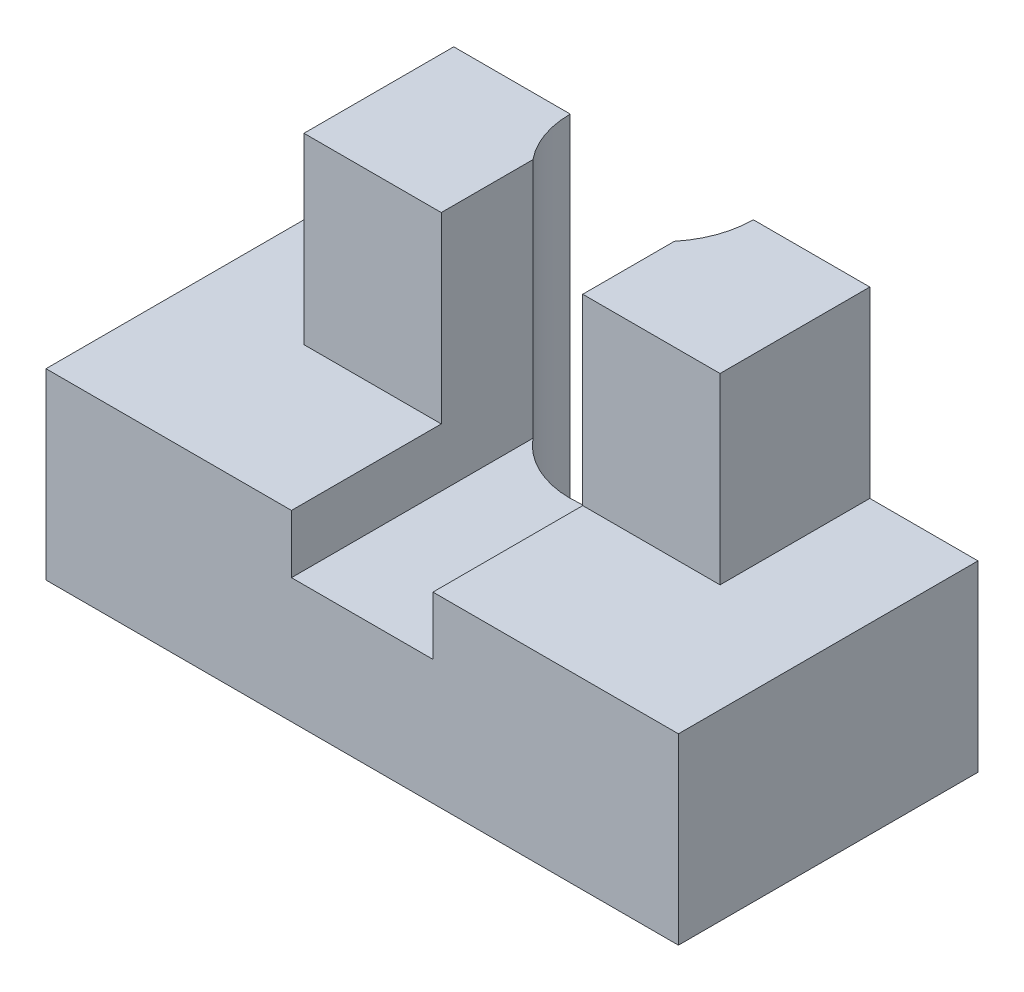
from build123d import *

# Parameters (mm, degrees)
SKETCH_1_W          = 76
SKETCH_1_H          = 36
EXTRUDE_1_DEPTH     = 22
EXTRUDE_2_DEPTH     = 22
SKETCH_4_W          = 17
SKETCH_4_H          = 33.729268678
CUT_EXTRUDE_1_DEPTH = 69.381283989
SKETCH_5_W          = 11
SKETCH_5_H          = 50.269507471


with BuildPart() as part:
    # Sketch 1 → Extrude 1 (new body)
    with BuildSketch(Plane(origin=(0, 0, 0), x_dir=(1, 0, 0), z_dir=(0, 1, 0))):
        Rectangle(SKETCH_1_W, SKETCH_1_H)
    extrude(amount=EXTRUDE_1_DEPTH)

    # Sketch 2 → Extrude 2 (add)
    with BuildSketch(Plane(origin=(0, 22, 0), x_dir=(1, 0, 0), z_dir=(0, 1, 0))):
        Polygon((0, 18), (25, 18), (25, 0), (0, 0), (-25, 0), (-25, 18), align=None)
    extrude(amount=EXTRUDE_2_DEPTH)

    # Sketch 4 → Cut-Extrude 1 (cut, through all)
    with BuildSketch(Plane.XY.offset(18)):
        with Locations((0, 31.864634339)):
            Rectangle(SKETCH_4_W, SKETCH_4_H)
    extrude(amount=-CUT_EXTRUDE_1_DEPTH, mode=Mode.SUBTRACT)

    # Sketch 5 → Cut-Revolve 1 (revolve, cut)
    with BuildSketch(Plane(origin=(0, 0, -18), x_dir=(-1, 0, 0), z_dir=(0, 0, -1))):
        with Locations((5.5, 25.134753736)):
            Rectangle(SKETCH_5_W, SKETCH_5_H)
    revolve(axis=Axis((0, 0, -18), (0, 1, 0)), mode=Mode.SUBTRACT)


solid = part.part
